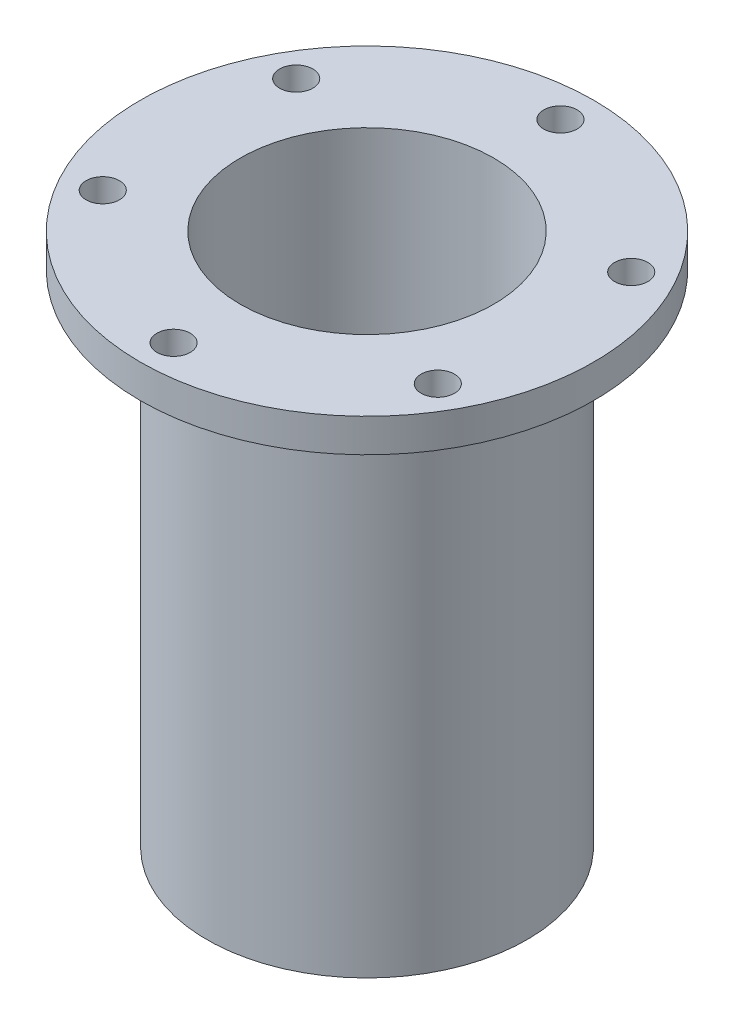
ISO-10303-21;
HEADER;
FILE_DESCRIPTION(('STEP AP214'),'2;1');
FILE_NAME('part.step','',(''),(''),'','','');
FILE_SCHEMA(('AUTOMOTIVE_DESIGN { 1 0 10303 214 1 1 1 1 }'));
ENDSEC;
DATA;
#1=APPLICATION_CONTEXT('core data for automotive mechanical design processes');
#2=APPLICATION_PROTOCOL_DEFINITION('international standard','automotive_design',2000,#1);
#3=PRODUCT_CONTEXT('',#1,'mechanical');
#4=PRODUCT('Part','Part','',(#3));
#5=PRODUCT_RELATED_PRODUCT_CATEGORY('part','',(#4));
#6=PRODUCT_DEFINITION_FORMATION('','',#4);
#7=PRODUCT_DEFINITION_CONTEXT('part definition',#1,'design');
#8=PRODUCT_DEFINITION('design','',#6,#7);
#9=PRODUCT_DEFINITION_SHAPE('','',#8);
#10=(LENGTH_UNIT() NAMED_UNIT(*) SI_UNIT(.MILLI.,.METRE.));
#11=(NAMED_UNIT(*) PLANE_ANGLE_UNIT() SI_UNIT($,.RADIAN.));
#12=(NAMED_UNIT(*) SI_UNIT($,.STERADIAN.) SOLID_ANGLE_UNIT());
#13=UNCERTAINTY_MEASURE_WITH_UNIT(LENGTH_MEASURE(1.E-05),#10,'distance_accuracy_value','');
#14=(GEOMETRIC_REPRESENTATION_CONTEXT(3) GLOBAL_UNCERTAINTY_ASSIGNED_CONTEXT((#13)) GLOBAL_UNIT_ASSIGNED_CONTEXT((#10,
#11,#12)) REPRESENTATION_CONTEXT('',''));
#15=CARTESIAN_POINT('',(0.,0.,0.));
#16=DIRECTION('',(0.,0.,1.));
#17=DIRECTION('',(1.,0.,0.));
#18=AXIS2_PLACEMENT_3D('',#15,#16,#17);
#19=CARTESIAN_POINT('',(24.,0.,0.));
#20=DIRECTION('',(0.,-1.,0.));
#21=DIRECTION('',(0.,0.,-1.));
#22=AXIS2_PLACEMENT_3D('',#19,#20,#21);
#23=PLANE('',#22);
#24=CARTESIAN_POINT('',(0.,0.,0.));
#25=DIRECTION('',(0.,-1.,0.));
#26=DIRECTION('',(0.,0.,-1.));
#27=AXIS2_PLACEMENT_3D('',#24,#25,#26);
#28=CIRCLE('',#27,24.);
#29=CARTESIAN_POINT('',(0.,0.,-24.));
#30=VERTEX_POINT('',#29);
#31=EDGE_CURVE('E78',#30,#30,#28,.T.);
#32=ORIENTED_EDGE('',*,*,#31,.T.);
#33=EDGE_LOOP('',(#32));
#34=FACE_BOUND('',#33,.T.);
#35=CARTESIAN_POINT('',(0.,0.,0.));
#36=DIRECTION('',(0.,-1.,0.));
#37=DIRECTION('',(0.,0.,-1.));
#38=AXIS2_PLACEMENT_3D('',#35,#36,#37);
#39=CIRCLE('',#38,19.);
#40=CARTESIAN_POINT('',(0.,0.,-19.));
#41=VERTEX_POINT('',#40);
#42=EDGE_CURVE('E10',#41,#41,#39,.T.);
#43=ORIENTED_EDGE('',*,*,#42,.F.);
#44=EDGE_LOOP('',(#43));
#45=FACE_BOUND('',#44,.T.);
#46=ADVANCED_FACE('F37',(#34,#45),#23,.T.);
#47=CARTESIAN_POINT('',(0.,0.,0.));
#48=DIRECTION('',(0.,-1.,0.));
#49=DIRECTION('',(0.,0.,-1.));
#50=AXIS2_PLACEMENT_3D('',#47,#48,#49);
#51=CYLINDRICAL_SURFACE('',#50,19.);
#52=ORIENTED_EDGE('',*,*,#42,.T.);
#53=EDGE_LOOP('',(#52));
#54=FACE_BOUND('',#53,.T.);
#55=CARTESIAN_POINT('',(0.,80.,0.));
#56=DIRECTION('',(0.,-1.,0.));
#57=DIRECTION('',(0.,0.,-1.));
#58=AXIS2_PLACEMENT_3D('',#55,#56,#57);
#59=CIRCLE('',#58,19.);
#60=CARTESIAN_POINT('',(0.,80.,-19.));
#61=VERTEX_POINT('',#60);
#62=EDGE_CURVE('E45',#61,#61,#59,.T.);
#63=ORIENTED_EDGE('',*,*,#62,.F.);
#64=EDGE_LOOP('',(#63));
#65=FACE_BOUND('',#64,.T.);
#66=ADVANCED_FACE('F106',(#54,#65),#51,.F.);
#67=CARTESIAN_POINT('',(19.,80.,0.));
#68=DIRECTION('',(0.,1.,0.));
#69=DIRECTION('',(0.,0.,1.));
#70=AXIS2_PLACEMENT_3D('',#67,#68,#69);
#71=PLANE('',#70);
#72=CARTESIAN_POINT('',(0.,80.,-29.));
#73=DIRECTION('',(0.,1.,0.));
#74=DIRECTION('',(0.,0.,1.));
#75=AXIS2_PLACEMENT_3D('',#72,#73,#74);
#76=CIRCLE('',#75,2.5);
#77=CARTESIAN_POINT('',(0.,80.,-26.5));
#78=VERTEX_POINT('',#77);
#79=EDGE_CURVE('E60',#78,#78,#76,.T.);
#80=ORIENTED_EDGE('',*,*,#79,.F.);
#81=EDGE_LOOP('',(#80));
#82=FACE_BOUND('',#81,.T.);
#83=CARTESIAN_POINT('',(-25.1147367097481,80.,-14.4999999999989));
#84=DIRECTION('',(0.,1.,0.));
#85=DIRECTION('',(0.,0.,1.));
#86=AXIS2_PLACEMENT_3D('',#83,#84,#85);
#87=CIRCLE('',#86,2.50000000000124);
#88=CARTESIAN_POINT('',(-25.1147367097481,80.,-11.9999999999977));
#89=VERTEX_POINT('',#88);
#90=EDGE_CURVE('E226',#89,#89,#87,.T.);
#91=ORIENTED_EDGE('',*,*,#90,.F.);
#92=EDGE_LOOP('',(#91));
#93=FACE_BOUND('',#92,.T.);
#94=CARTESIAN_POINT('',(-25.1147367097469,80.,14.5000000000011));
#95=DIRECTION('',(0.,1.,0.));
#96=DIRECTION('',(0.,0.,1.));
#97=AXIS2_PLACEMENT_3D('',#94,#95,#96);
#98=CIRCLE('',#97,2.50000000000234);
#99=CARTESIAN_POINT('',(-25.1147367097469,80.,17.0000000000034));
#100=VERTEX_POINT('',#99);
#101=EDGE_CURVE('E92',#100,#100,#98,.T.);
#102=ORIENTED_EDGE('',*,*,#101,.F.);
#103=EDGE_LOOP('',(#102));
#104=FACE_BOUND('',#103,.T.);
#105=CARTESIAN_POINT('',(2.46203429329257E-12,80.,29.));
#106=DIRECTION('',(0.,1.,0.));
#107=DIRECTION('',(0.,0.,1.));
#108=AXIS2_PLACEMENT_3D('',#105,#106,#107);
#109=CIRCLE('',#108,2.50000000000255);
#110=CARTESIAN_POINT('',(2.46203429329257E-12,80.,31.5000000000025));
#111=VERTEX_POINT('',#110);
#112=EDGE_CURVE('E232',#111,#111,#109,.T.);
#113=ORIENTED_EDGE('',*,*,#112,.F.);
#114=EDGE_LOOP('',(#113));
#115=FACE_BOUND('',#114,.T.);
#116=CARTESIAN_POINT('',(25.1147367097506,80.,14.4999999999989));
#117=DIRECTION('',(0.,1.,0.));
#118=DIRECTION('',(0.,0.,1.));
#119=AXIS2_PLACEMENT_3D('',#116,#117,#118);
#120=CIRCLE('',#119,2.50000000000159);
#121=CARTESIAN_POINT('',(25.1147367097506,80.,17.0000000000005));
#122=VERTEX_POINT('',#121);
#123=EDGE_CURVE('E223',#122,#122,#120,.T.);
#124=ORIENTED_EDGE('',*,*,#123,.F.);
#125=EDGE_LOOP('',(#124));
#126=FACE_BOUND('',#125,.T.);
#127=CARTESIAN_POINT('',(25.1147367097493,80.,-14.5000000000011));
#128=DIRECTION('',(0.,1.,0.));
#129=DIRECTION('',(0.,0.,1.));
#130=AXIS2_PLACEMENT_3D('',#127,#128,#129);
#131=CIRCLE('',#130,2.50000000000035);
#132=CARTESIAN_POINT('',(25.1147367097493,80.,-12.0000000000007));
#133=VERTEX_POINT('',#132);
#134=EDGE_CURVE('E219',#133,#133,#131,.T.);
#135=ORIENTED_EDGE('',*,*,#134,.F.);
#136=EDGE_LOOP('',(#135));
#137=FACE_BOUND('',#136,.T.);
#138=ORIENTED_EDGE('',*,*,#62,.T.);
#139=EDGE_LOOP('',(#138));
#140=FACE_BOUND('',#139,.T.);
#141=CARTESIAN_POINT('',(0.,80.,0.));
#142=DIRECTION('',(0.,-1.,0.));
#143=DIRECTION('',(0.,0.,-1.));
#144=AXIS2_PLACEMENT_3D('',#141,#142,#143);
#145=CIRCLE('',#144,34.);
#146=CARTESIAN_POINT('',(0.,80.,-34.));
#147=VERTEX_POINT('',#146);
#148=EDGE_CURVE('E51',#147,#147,#145,.T.);
#149=ORIENTED_EDGE('',*,*,#148,.F.);
#150=EDGE_LOOP('',(#149));
#151=FACE_BOUND('',#150,.T.);
#152=ADVANCED_FACE('F104',(#82,#93,#104,#115,#126,#137,#140,#151),#71,.T.);
#153=CARTESIAN_POINT('',(0.,0.,0.));
#154=DIRECTION('',(0.,-1.,0.));
#155=DIRECTION('',(0.,0.,-1.));
#156=AXIS2_PLACEMENT_3D('',#153,#154,#155);
#157=CYLINDRICAL_SURFACE('',#156,34.);
#158=ORIENTED_EDGE('',*,*,#148,.T.);
#159=EDGE_LOOP('',(#158));
#160=FACE_BOUND('',#159,.T.);
#161=CARTESIAN_POINT('',(0.,75.,0.));
#162=DIRECTION('',(0.,-1.,0.));
#163=DIRECTION('',(0.,0.,-1.));
#164=AXIS2_PLACEMENT_3D('',#161,#162,#163);
#165=CIRCLE('',#164,34.);
#166=CARTESIAN_POINT('',(0.,75.,-34.));
#167=VERTEX_POINT('',#166);
#168=EDGE_CURVE('E89',#167,#167,#165,.T.);
#169=ORIENTED_EDGE('',*,*,#168,.F.);
#170=EDGE_LOOP('',(#169));
#171=FACE_BOUND('',#170,.T.);
#172=ADVANCED_FACE('F101',(#160,#171),#157,.T.);
#173=CARTESIAN_POINT('',(34.,75.,0.));
#174=DIRECTION('',(0.,-1.,0.));
#175=DIRECTION('',(0.,0.,-1.));
#176=AXIS2_PLACEMENT_3D('',#173,#174,#175);
#177=PLANE('',#176);
#178=CARTESIAN_POINT('',(0.,75.,-29.));
#179=DIRECTION('',(0.,-1.,0.));
#180=DIRECTION('',(0.,0.,-1.));
#181=AXIS2_PLACEMENT_3D('',#178,#179,#180);
#182=CIRCLE('',#181,2.5);
#183=CARTESIAN_POINT('',(0.,75.,-31.5));
#184=VERTEX_POINT('',#183);
#185=EDGE_CURVE('E40',#184,#184,#182,.T.);
#186=ORIENTED_EDGE('',*,*,#185,.F.);
#187=EDGE_LOOP('',(#186));
#188=FACE_BOUND('',#187,.T.);
#189=CARTESIAN_POINT('',(-25.1147367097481,75.,-14.4999999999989));
#190=DIRECTION('',(0.,-1.,0.));
#191=DIRECTION('',(0.,0.,-1.));
#192=AXIS2_PLACEMENT_3D('',#189,#190,#191);
#193=CIRCLE('',#192,2.50000000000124);
#194=CARTESIAN_POINT('',(-25.1147367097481,75.,-17.0000000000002));
#195=VERTEX_POINT('',#194);
#196=EDGE_CURVE('E71',#195,#195,#193,.T.);
#197=ORIENTED_EDGE('',*,*,#196,.F.);
#198=EDGE_LOOP('',(#197));
#199=FACE_BOUND('',#198,.T.);
#200=CARTESIAN_POINT('',(-25.1147367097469,75.,14.5000000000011));
#201=DIRECTION('',(0.,-1.,0.));
#202=DIRECTION('',(0.,0.,-1.));
#203=AXIS2_PLACEMENT_3D('',#200,#201,#202);
#204=CIRCLE('',#203,2.50000000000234);
#205=CARTESIAN_POINT('',(-25.1147367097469,75.,11.9999999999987));
#206=VERTEX_POINT('',#205);
#207=EDGE_CURVE('E68',#206,#206,#204,.T.);
#208=ORIENTED_EDGE('',*,*,#207,.F.);
#209=EDGE_LOOP('',(#208));
#210=FACE_BOUND('',#209,.T.);
#211=CARTESIAN_POINT('',(2.46203429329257E-12,75.,29.));
#212=DIRECTION('',(0.,-1.,0.));
#213=DIRECTION('',(0.,0.,-1.));
#214=AXIS2_PLACEMENT_3D('',#211,#212,#213);
#215=CIRCLE('',#214,2.50000000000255);
#216=CARTESIAN_POINT('',(2.46203429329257E-12,75.,26.4999999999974));
#217=VERTEX_POINT('',#216);
#218=EDGE_CURVE('E64',#217,#217,#215,.T.);
#219=ORIENTED_EDGE('',*,*,#218,.F.);
#220=EDGE_LOOP('',(#219));
#221=FACE_BOUND('',#220,.T.);
#222=CARTESIAN_POINT('',(25.1147367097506,75.,14.4999999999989));
#223=DIRECTION('',(0.,-1.,0.));
#224=DIRECTION('',(0.,0.,-1.));
#225=AXIS2_PLACEMENT_3D('',#222,#223,#224);
#226=CIRCLE('',#225,2.50000000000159);
#227=CARTESIAN_POINT('',(25.1147367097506,75.,11.9999999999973));
#228=VERTEX_POINT('',#227);
#229=EDGE_CURVE('E59',#228,#228,#226,.T.);
#230=ORIENTED_EDGE('',*,*,#229,.F.);
#231=EDGE_LOOP('',(#230));
#232=FACE_BOUND('',#231,.T.);
#233=CARTESIAN_POINT('',(25.1147367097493,75.,-14.5000000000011));
#234=DIRECTION('',(0.,-1.,0.));
#235=DIRECTION('',(0.,0.,-1.));
#236=AXIS2_PLACEMENT_3D('',#233,#234,#235);
#237=CIRCLE('',#236,2.50000000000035);
#238=CARTESIAN_POINT('',(25.1147367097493,75.,-17.0000000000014));
#239=VERTEX_POINT('',#238);
#240=EDGE_CURVE('E55',#239,#239,#237,.T.);
#241=ORIENTED_EDGE('',*,*,#240,.F.);
#242=EDGE_LOOP('',(#241));
#243=FACE_BOUND('',#242,.T.);
#244=ORIENTED_EDGE('',*,*,#168,.T.);
#245=EDGE_LOOP('',(#244));
#246=FACE_BOUND('',#245,.T.);
#247=CARTESIAN_POINT('',(0.,75.,0.));
#248=DIRECTION('',(0.,-1.,0.));
#249=DIRECTION('',(0.,0.,-1.));
#250=AXIS2_PLACEMENT_3D('',#247,#248,#249);
#251=CIRCLE('',#250,24.);
#252=CARTESIAN_POINT('',(0.,75.,-24.));
#253=VERTEX_POINT('',#252);
#254=EDGE_CURVE('E83',#253,#253,#251,.T.);
#255=ORIENTED_EDGE('',*,*,#254,.F.);
#256=EDGE_LOOP('',(#255));
#257=FACE_BOUND('',#256,.T.);
#258=ADVANCED_FACE('F113',(#188,#199,#210,#221,#232,#243,#246,#257),#177,.T.);
#259=CARTESIAN_POINT('',(0.,0.,0.));
#260=DIRECTION('',(0.,-1.,0.));
#261=DIRECTION('',(0.,0.,-1.));
#262=AXIS2_PLACEMENT_3D('',#259,#260,#261);
#263=CYLINDRICAL_SURFACE('',#262,24.);
#264=ORIENTED_EDGE('',*,*,#254,.T.);
#265=EDGE_LOOP('',(#264));
#266=FACE_BOUND('',#265,.T.);
#267=ORIENTED_EDGE('',*,*,#31,.F.);
#268=EDGE_LOOP('',(#267));
#269=FACE_BOUND('',#268,.T.);
#270=ADVANCED_FACE('F139',(#266,#269),#263,.T.);
#271=CARTESIAN_POINT('',(25.1147367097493,70.,-14.5000000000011));
#272=DIRECTION('',(0.,1.,0.));
#273=DIRECTION('',(0.,0.,1.));
#274=AXIS2_PLACEMENT_3D('',#271,#272,#273);
#275=CYLINDRICAL_SURFACE('',#274,2.50000000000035);
#276=ORIENTED_EDGE('',*,*,#240,.T.);
#277=EDGE_LOOP('',(#276));
#278=FACE_BOUND('',#277,.T.);
#279=ORIENTED_EDGE('',*,*,#134,.T.);
#280=EDGE_LOOP('',(#279));
#281=FACE_BOUND('',#280,.T.);
#282=ADVANCED_FACE('F143',(#278,#281),#275,.F.);
#283=CARTESIAN_POINT('',(25.1147367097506,70.,14.4999999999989));
#284=DIRECTION('',(0.,1.,0.));
#285=DIRECTION('',(0.,0.,1.));
#286=AXIS2_PLACEMENT_3D('',#283,#284,#285);
#287=CYLINDRICAL_SURFACE('',#286,2.50000000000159);
#288=ORIENTED_EDGE('',*,*,#229,.T.);
#289=EDGE_LOOP('',(#288));
#290=FACE_BOUND('',#289,.T.);
#291=ORIENTED_EDGE('',*,*,#123,.T.);
#292=EDGE_LOOP('',(#291));
#293=FACE_BOUND('',#292,.T.);
#294=ADVANCED_FACE('F164',(#290,#293),#287,.F.);
#295=CARTESIAN_POINT('',(2.46203429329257E-12,70.,29.));
#296=DIRECTION('',(0.,1.,0.));
#297=DIRECTION('',(0.,0.,1.));
#298=AXIS2_PLACEMENT_3D('',#295,#296,#297);
#299=CYLINDRICAL_SURFACE('',#298,2.50000000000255);
#300=ORIENTED_EDGE('',*,*,#218,.T.);
#301=EDGE_LOOP('',(#300));
#302=FACE_BOUND('',#301,.T.);
#303=ORIENTED_EDGE('',*,*,#112,.T.);
#304=EDGE_LOOP('',(#303));
#305=FACE_BOUND('',#304,.T.);
#306=ADVANCED_FACE('F174',(#302,#305),#299,.F.);
#307=CARTESIAN_POINT('',(-25.1147367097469,70.,14.5000000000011));
#308=DIRECTION('',(0.,1.,0.));
#309=DIRECTION('',(0.,0.,1.));
#310=AXIS2_PLACEMENT_3D('',#307,#308,#309);
#311=CYLINDRICAL_SURFACE('',#310,2.50000000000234);
#312=ORIENTED_EDGE('',*,*,#207,.T.);
#313=EDGE_LOOP('',(#312));
#314=FACE_BOUND('',#313,.T.);
#315=ORIENTED_EDGE('',*,*,#101,.T.);
#316=EDGE_LOOP('',(#315));
#317=FACE_BOUND('',#316,.T.);
#318=ADVANCED_FACE('F184',(#314,#317),#311,.F.);
#319=CARTESIAN_POINT('',(-25.1147367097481,70.,-14.4999999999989));
#320=DIRECTION('',(0.,1.,0.));
#321=DIRECTION('',(0.,0.,1.));
#322=AXIS2_PLACEMENT_3D('',#319,#320,#321);
#323=CYLINDRICAL_SURFACE('',#322,2.50000000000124);
#324=ORIENTED_EDGE('',*,*,#196,.T.);
#325=EDGE_LOOP('',(#324));
#326=FACE_BOUND('',#325,.T.);
#327=ORIENTED_EDGE('',*,*,#90,.T.);
#328=EDGE_LOOP('',(#327));
#329=FACE_BOUND('',#328,.T.);
#330=ADVANCED_FACE('F194',(#326,#329),#323,.F.);
#331=CARTESIAN_POINT('',(0.,70.,-29.));
#332=DIRECTION('',(0.,1.,0.));
#333=DIRECTION('',(0.,0.,1.));
#334=AXIS2_PLACEMENT_3D('',#331,#332,#333);
#335=CYLINDRICAL_SURFACE('',#334,2.5);
#336=ORIENTED_EDGE('',*,*,#185,.T.);
#337=EDGE_LOOP('',(#336));
#338=FACE_BOUND('',#337,.T.);
#339=ORIENTED_EDGE('',*,*,#79,.T.);
#340=EDGE_LOOP('',(#339));
#341=FACE_BOUND('',#340,.T.);
#342=ADVANCED_FACE('F204',(#338,#341),#335,.F.);
#343=CLOSED_SHELL('',(#46,#66,#152,#172,#258,#270,#282,#294,#306,#318,#330,#342));
#344=MANIFOLD_SOLID_BREP('B2',#343);
#345=ADVANCED_BREP_SHAPE_REPRESENTATION('',(#18,#344),#14);
#346=SHAPE_DEFINITION_REPRESENTATION(#9,#345);
ENDSEC;
END-ISO-10303-21;
